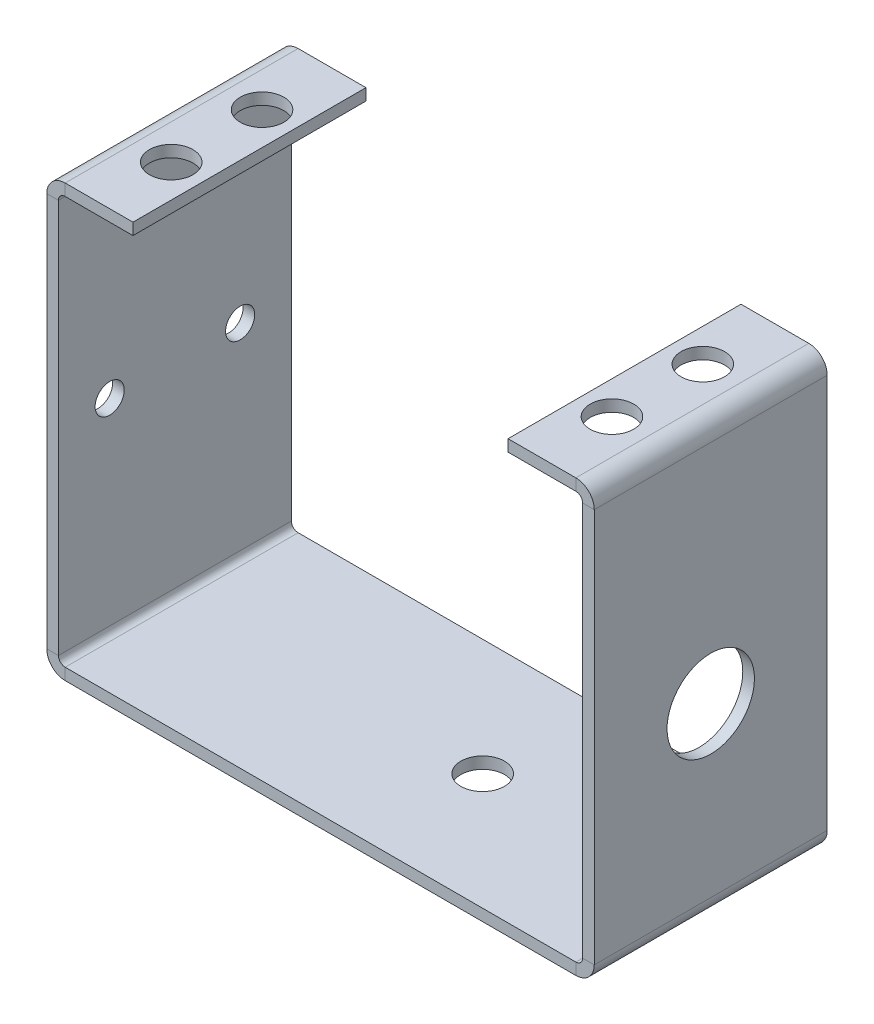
ISO-10303-21;
HEADER;
FILE_DESCRIPTION(('STEP AP214'),'2;1');
FILE_NAME('part.step','',(''),(''),'','','');
FILE_SCHEMA(('AUTOMOTIVE_DESIGN { 1 0 10303 214 1 1 1 1 }'));
ENDSEC;
DATA;
#1=APPLICATION_CONTEXT('core data for automotive mechanical design processes');
#2=APPLICATION_PROTOCOL_DEFINITION('international standard','automotive_design',2000,#1);
#3=PRODUCT_CONTEXT('',#1,'mechanical');
#4=PRODUCT('Part','Part','',(#3));
#5=PRODUCT_RELATED_PRODUCT_CATEGORY('part','',(#4));
#6=PRODUCT_DEFINITION_FORMATION('','',#4);
#7=PRODUCT_DEFINITION_CONTEXT('part definition',#1,'design');
#8=PRODUCT_DEFINITION('design','',#6,#7);
#9=PRODUCT_DEFINITION_SHAPE('','',#8);
#10=(LENGTH_UNIT() NAMED_UNIT(*) SI_UNIT(.MILLI.,.METRE.));
#11=(NAMED_UNIT(*) PLANE_ANGLE_UNIT() SI_UNIT($,.RADIAN.));
#12=(NAMED_UNIT(*) SI_UNIT($,.STERADIAN.) SOLID_ANGLE_UNIT());
#13=UNCERTAINTY_MEASURE_WITH_UNIT(LENGTH_MEASURE(1.E-05),#10,'distance_accuracy_value','');
#14=(GEOMETRIC_REPRESENTATION_CONTEXT(3) GLOBAL_UNCERTAINTY_ASSIGNED_CONTEXT((#13)) GLOBAL_UNIT_ASSIGNED_CONTEXT((#10,
#11,#12)) REPRESENTATION_CONTEXT('',''));
#15=CARTESIAN_POINT('',(0.,0.,0.));
#16=DIRECTION('',(0.,0.,1.));
#17=DIRECTION('',(1.,0.,0.));
#18=AXIS2_PLACEMENT_3D('',#15,#16,#17);
#19=CARTESIAN_POINT('',(3.12471507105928E-13,45.7200000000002,0.));
#20=DIRECTION('',(0.,1.,0.));
#21=DIRECTION('',(-1.,0.,0.));
#22=AXIS2_PLACEMENT_3D('',#19,#20,#21);
#23=PLANE('',#22);
#24=CARTESIAN_POINT('',(24.0284000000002,45.72,4.953));
#25=DIRECTION('',(0.,-1.,0.));
#26=DIRECTION('',(1.,0.,0.));
#27=AXIS2_PLACEMENT_3D('',#24,#25,#26);
#28=CIRCLE('',#27,2.3749);
#29=CARTESIAN_POINT('',(26.4033000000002,45.72,4.953));
#30=VERTEX_POINT('',#29);
#31=EDGE_CURVE('E395',#30,#30,#28,.T.);
#32=ORIENTED_EDGE('',*,*,#31,.T.);
#33=EDGE_LOOP('',(#32));
#34=FACE_BOUND('',#33,.T.);
#35=DIRECTION('',(-1.,0.,0.));
#36=VECTOR('',#35,1.);
#37=CARTESIAN_POINT('',(20.4470000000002,45.7200000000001,12.7));
#38=LINE('',#37,#36);
#39=CARTESIAN_POINT('',(27.8384000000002,45.72,12.7));
#40=VERTEX_POINT('',#39);
#41=CARTESIAN_POINT('',(20.4470000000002,45.7200000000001,12.7));
#42=VERTEX_POINT('',#41);
#43=EDGE_CURVE('E289',#40,#42,#38,.T.);
#44=ORIENTED_EDGE('',*,*,#43,.F.);
#45=DIRECTION('',(0.,0.,-1.));
#46=VECTOR('',#45,1.);
#47=CARTESIAN_POINT('',(27.8384000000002,45.72,0.));
#48=LINE('',#47,#46);
#49=CARTESIAN_POINT('',(27.8384000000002,45.72,-12.7));
#50=VERTEX_POINT('',#49);
#51=EDGE_CURVE('E283',#40,#50,#48,.T.);
#52=ORIENTED_EDGE('',*,*,#51,.T.);
#53=DIRECTION('',(1.,0.,0.));
#54=VECTOR('',#53,1.);
#55=CARTESIAN_POINT('',(28.5750000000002,45.72,-12.7));
#56=LINE('',#55,#54);
#57=CARTESIAN_POINT('',(20.4470000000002,45.7200000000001,-12.7));
#58=VERTEX_POINT('',#57);
#59=EDGE_CURVE('E295',#58,#50,#56,.T.);
#60=ORIENTED_EDGE('',*,*,#59,.F.);
#61=DIRECTION('',(0.,0.,-1.));
#62=VECTOR('',#61,1.);
#63=CARTESIAN_POINT('',(20.4470000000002,45.7200000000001,-12.7));
#64=LINE('',#63,#62);
#65=EDGE_CURVE('E291',#42,#58,#64,.T.);
#66=ORIENTED_EDGE('',*,*,#65,.F.);
#67=EDGE_LOOP('',(#44,#52,#60,#66));
#68=FACE_BOUND('',#67,.T.);
#69=CARTESIAN_POINT('',(24.0284000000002,45.72,-4.953));
#70=DIRECTION('',(0.,-1.,0.));
#71=DIRECTION('',(1.,0.,0.));
#72=AXIS2_PLACEMENT_3D('',#69,#70,#71);
#73=CIRCLE('',#72,2.3749);
#74=CARTESIAN_POINT('',(26.4033000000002,45.72,-4.953));
#75=VERTEX_POINT('',#74);
#76=EDGE_CURVE('E399',#75,#75,#73,.T.);
#77=ORIENTED_EDGE('',*,*,#76,.T.);
#78=EDGE_LOOP('',(#77));
#79=FACE_BOUND('',#78,.T.);
#80=ADVANCED_FACE('F35',(#34,#68,#79),#23,.T.);
#81=CARTESIAN_POINT('',(3.03576608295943E-13,44.4500000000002,0.));
#82=DIRECTION('',(0.,1.,0.));
#83=DIRECTION('',(-1.,0.,0.));
#84=AXIS2_PLACEMENT_3D('',#81,#82,#83);
#85=PLANE('',#84);
#86=CARTESIAN_POINT('',(24.0284000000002,44.45,4.953));
#87=DIRECTION('',(0.,1.,0.));
#88=DIRECTION('',(-1.,0.,0.));
#89=AXIS2_PLACEMENT_3D('',#86,#87,#88);
#90=CIRCLE('',#89,2.3749);
#91=CARTESIAN_POINT('',(21.6535000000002,44.45,4.953));
#92=VERTEX_POINT('',#91);
#93=EDGE_CURVE('E392',#92,#92,#90,.F.);
#94=ORIENTED_EDGE('',*,*,#93,.F.);
#95=EDGE_LOOP('',(#94));
#96=FACE_BOUND('',#95,.T.);
#97=DIRECTION('',(0.,0.,-1.));
#98=VECTOR('',#97,1.);
#99=CARTESIAN_POINT('',(27.8384000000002,44.45,12.7));
#100=LINE('',#99,#98);
#101=CARTESIAN_POINT('',(27.8384000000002,44.45,12.7));
#102=VERTEX_POINT('',#101);
#103=CARTESIAN_POINT('',(27.8384000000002,44.45,-12.7));
#104=VERTEX_POINT('',#103);
#105=EDGE_CURVE('E278',#102,#104,#100,.T.);
#106=ORIENTED_EDGE('',*,*,#105,.F.);
#107=DIRECTION('',(-1.,0.,0.));
#108=VECTOR('',#107,1.);
#109=CARTESIAN_POINT('',(20.4470000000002,44.4500000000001,12.7));
#110=LINE('',#109,#108);
#111=CARTESIAN_POINT('',(20.4470000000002,44.4500000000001,12.7));
#112=VERTEX_POINT('',#111);
#113=EDGE_CURVE('E288',#102,#112,#110,.T.);
#114=ORIENTED_EDGE('',*,*,#113,.T.);
#115=DIRECTION('',(0.,0.,-1.));
#116=VECTOR('',#115,1.);
#117=CARTESIAN_POINT('',(20.4470000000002,44.4500000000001,-12.7));
#118=LINE('',#117,#116);
#119=CARTESIAN_POINT('',(20.4470000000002,44.4500000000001,-12.7));
#120=VERTEX_POINT('',#119);
#121=EDGE_CURVE('E300',#112,#120,#118,.T.);
#122=ORIENTED_EDGE('',*,*,#121,.T.);
#123=DIRECTION('',(1.,0.,0.));
#124=VECTOR('',#123,1.);
#125=CARTESIAN_POINT('',(28.5750000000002,44.45,-12.7));
#126=LINE('',#125,#124);
#127=EDGE_CURVE('E292',#120,#104,#126,.T.);
#128=ORIENTED_EDGE('',*,*,#127,.T.);
#129=EDGE_LOOP('',(#106,#114,#122,#128));
#130=FACE_BOUND('',#129,.T.);
#131=CARTESIAN_POINT('',(24.0284000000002,44.45,-4.953));
#132=DIRECTION('',(0.,1.,0.));
#133=DIRECTION('',(-1.,0.,0.));
#134=AXIS2_PLACEMENT_3D('',#131,#132,#133);
#135=CIRCLE('',#134,2.3749);
#136=CARTESIAN_POINT('',(21.6535000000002,44.45,-4.953));
#137=VERTEX_POINT('',#136);
#138=EDGE_CURVE('E396',#137,#137,#135,.F.);
#139=ORIENTED_EDGE('',*,*,#138,.F.);
#140=EDGE_LOOP('',(#139));
#141=FACE_BOUND('',#140,.T.);
#142=ADVANCED_FACE('F474',(#96,#130,#141),#85,.F.);
#143=CARTESIAN_POINT('',(-29.845,0.,12.7));
#144=DIRECTION('',(0.,0.,1.));
#145=DIRECTION('',(1.,0.,0.));
#146=AXIS2_PLACEMENT_3D('',#143,#144,#145);
#147=PLANE('',#146);
#148=DIRECTION('',(0.,-1.,0.));
#149=VECTOR('',#148,1.);
#150=CARTESIAN_POINT('',(-28.575,0.,12.7));
#151=LINE('',#150,#149);
#152=CARTESIAN_POINT('',(-28.5750000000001,43.7134,12.7));
#153=VERTEX_POINT('',#152);
#154=CARTESIAN_POINT('',(-28.575,0.736599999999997,12.7));
#155=VERTEX_POINT('',#154);
#156=EDGE_CURVE('E245',#153,#155,#151,.T.);
#157=ORIENTED_EDGE('',*,*,#156,.F.);
#158=DIRECTION('',(-1.,0.,0.));
#159=VECTOR('',#158,1.);
#160=CARTESIAN_POINT('',(-28.5750000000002,43.7134,12.7));
#161=LINE('',#160,#159);
#162=CARTESIAN_POINT('',(-29.8450000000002,43.7134,12.7));
#163=VERTEX_POINT('',#162);
#164=EDGE_CURVE('E220',#153,#163,#161,.T.);
#165=ORIENTED_EDGE('',*,*,#164,.T.);
#166=DIRECTION('',(0.,-1.,0.));
#167=VECTOR('',#166,1.);
#168=CARTESIAN_POINT('',(-29.845,0.,12.7));
#169=LINE('',#168,#167);
#170=CARTESIAN_POINT('',(-29.845,0.736599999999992,12.7));
#171=VERTEX_POINT('',#170);
#172=EDGE_CURVE('E246',#163,#171,#169,.T.);
#173=ORIENTED_EDGE('',*,*,#172,.T.);
#174=DIRECTION('',(-1.,0.,0.));
#175=VECTOR('',#174,1.);
#176=CARTESIAN_POINT('',(-28.575,0.736599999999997,12.7));
#177=LINE('',#176,#175);
#178=EDGE_CURVE('E238',#155,#171,#177,.T.);
#179=ORIENTED_EDGE('',*,*,#178,.F.);
#180=EDGE_LOOP('',(#157,#165,#173,#179));
#181=FACE_BOUND('',#180,.T.);
#182=ADVANCED_FACE('F450',(#181),#147,.T.);
#183=CARTESIAN_POINT('',(-29.845,-1.0480032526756E-13,0.));
#184=DIRECTION('',(1.,0.,0.));
#185=DIRECTION('',(0.,-1.,0.));
#186=AXIS2_PLACEMENT_3D('',#183,#184,#185);
#187=PLANE('',#186);
#188=CARTESIAN_POINT('',(-29.8450000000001,22.225,-7.112));
#189=DIRECTION('',(-1.,0.,0.));
#190=DIRECTION('',(0.,1.,0.));
#191=AXIS2_PLACEMENT_3D('',#188,#189,#190);
#192=CIRCLE('',#191,1.5875);
#193=CARTESIAN_POINT('',(-29.8450000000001,23.8125,-7.112));
#194=VERTEX_POINT('',#193);
#195=EDGE_CURVE('E405',#194,#194,#192,.T.);
#196=ORIENTED_EDGE('',*,*,#195,.F.);
#197=EDGE_LOOP('',(#196));
#198=FACE_BOUND('',#197,.T.);
#199=CARTESIAN_POINT('',(-29.8450000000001,22.225,7.112));
#200=DIRECTION('',(-1.,0.,0.));
#201=DIRECTION('',(0.,-1.,0.));
#202=AXIS2_PLACEMENT_3D('',#199,#200,#201);
#203=CIRCLE('',#202,1.5875);
#204=CARTESIAN_POINT('',(-29.8450000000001,20.6375,7.112));
#205=VERTEX_POINT('',#204);
#206=EDGE_CURVE('E402',#205,#205,#203,.T.);
#207=ORIENTED_EDGE('',*,*,#206,.F.);
#208=EDGE_LOOP('',(#207));
#209=FACE_BOUND('',#208,.T.);
#210=DIRECTION('',(0.,0.,1.));
#211=VECTOR('',#210,1.);
#212=CARTESIAN_POINT('',(-29.8450000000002,43.7134,12.7));
#213=LINE('',#212,#211);
#214=CARTESIAN_POINT('',(-29.8450000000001,43.7134,-12.7));
#215=VERTEX_POINT('',#214);
#216=EDGE_CURVE('E214',#163,#215,#213,.F.);
#217=ORIENTED_EDGE('',*,*,#216,.T.);
#218=DIRECTION('',(0.,1.,0.));
#219=VECTOR('',#218,1.);
#220=CARTESIAN_POINT('',(-29.8450000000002,44.45,-12.7));
#221=LINE('',#220,#219);
#222=CARTESIAN_POINT('',(-29.845,0.736599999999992,-12.7));
#223=VERTEX_POINT('',#222);
#224=EDGE_CURVE('E248',#223,#215,#221,.T.);
#225=ORIENTED_EDGE('',*,*,#224,.F.);
#226=DIRECTION('',(0.,0.,-1.));
#227=VECTOR('',#226,1.);
#228=CARTESIAN_POINT('',(-29.845,0.736599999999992,0.));
#229=LINE('',#228,#227);
#230=EDGE_CURVE('E241',#171,#223,#229,.T.);
#231=ORIENTED_EDGE('',*,*,#230,.F.);
#232=ORIENTED_EDGE('',*,*,#172,.F.);
#233=EDGE_LOOP('',(#217,#225,#231,#232));
#234=FACE_BOUND('',#233,.T.);
#235=ADVANCED_FACE('F456',(#198,#209,#234),#187,.F.);
#236=CARTESIAN_POINT('',(-28.575,-1.0036614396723E-13,0.));
#237=DIRECTION('',(1.,0.,0.));
#238=DIRECTION('',(0.,-1.,0.));
#239=AXIS2_PLACEMENT_3D('',#236,#237,#238);
#240=PLANE('',#239);
#241=CARTESIAN_POINT('',(-28.5750000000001,22.225,-7.112));
#242=DIRECTION('',(1.,0.,0.));
#243=DIRECTION('',(0.,1.,0.));
#244=AXIS2_PLACEMENT_3D('',#241,#242,#243);
#245=CIRCLE('',#244,1.5875);
#246=CARTESIAN_POINT('',(-28.5750000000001,23.8125,-7.112));
#247=VERTEX_POINT('',#246);
#248=EDGE_CURVE('E403',#247,#247,#245,.T.);
#249=ORIENTED_EDGE('',*,*,#248,.F.);
#250=EDGE_LOOP('',(#249));
#251=FACE_BOUND('',#250,.T.);
#252=CARTESIAN_POINT('',(-28.5750000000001,22.225,7.112));
#253=DIRECTION('',(1.,0.,0.));
#254=DIRECTION('',(0.,1.,0.));
#255=AXIS2_PLACEMENT_3D('',#252,#253,#254);
#256=CIRCLE('',#255,1.5875);
#257=CARTESIAN_POINT('',(-28.5750000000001,23.8125,7.112));
#258=VERTEX_POINT('',#257);
#259=EDGE_CURVE('E400',#258,#258,#256,.T.);
#260=ORIENTED_EDGE('',*,*,#259,.F.);
#261=EDGE_LOOP('',(#260));
#262=FACE_BOUND('',#261,.T.);
#263=DIRECTION('',(0.,1.,0.));
#264=VECTOR('',#263,1.);
#265=CARTESIAN_POINT('',(-28.5750000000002,44.45,-12.7));
#266=LINE('',#265,#264);
#267=CARTESIAN_POINT('',(-28.575,0.736599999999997,-12.7));
#268=VERTEX_POINT('',#267);
#269=CARTESIAN_POINT('',(-28.5750000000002,43.7134,-12.7));
#270=VERTEX_POINT('',#269);
#271=EDGE_CURVE('E249',#268,#270,#266,.T.);
#272=ORIENTED_EDGE('',*,*,#271,.T.);
#273=DIRECTION('',(0.,0.,1.));
#274=VECTOR('',#273,1.);
#275=CARTESIAN_POINT('',(-28.5750000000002,43.7134,12.7));
#276=LINE('',#275,#274);
#277=EDGE_CURVE('E52',#153,#270,#276,.F.);
#278=ORIENTED_EDGE('',*,*,#277,.F.);
#279=ORIENTED_EDGE('',*,*,#156,.T.);
#280=DIRECTION('',(0.,0.,1.));
#281=VECTOR('',#280,1.);
#282=CARTESIAN_POINT('',(-28.575,0.736599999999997,-12.7));
#283=LINE('',#282,#281);
#284=EDGE_CURVE('E235',#268,#155,#283,.T.);
#285=ORIENTED_EDGE('',*,*,#284,.F.);
#286=EDGE_LOOP('',(#272,#278,#279,#285));
#287=FACE_BOUND('',#286,.T.);
#288=ADVANCED_FACE('F553',(#251,#262,#287),#240,.T.);
#289=CARTESIAN_POINT('',(0.,-1.27,0.));
#290=DIRECTION('',(0.,-1.,0.));
#291=DIRECTION('',(0.,0.,-1.));
#292=AXIS2_PLACEMENT_3D('',#289,#290,#291);
#293=PLANE('',#292);
#294=CARTESIAN_POINT('',(4.9784,-1.27,0.));
#295=DIRECTION('',(0.,-1.,0.));
#296=DIRECTION('',(0.,0.,-1.));
#297=AXIS2_PLACEMENT_3D('',#294,#295,#296);
#298=CIRCLE('',#297,2.38125);
#299=CARTESIAN_POINT('',(4.9784,-1.27,-2.38125));
#300=VERTEX_POINT('',#299);
#301=EDGE_CURVE('E415',#300,#300,#298,.T.);
#302=ORIENTED_EDGE('',*,*,#301,.F.);
#303=EDGE_LOOP('',(#302));
#304=FACE_BOUND('',#303,.T.);
#305=DIRECTION('',(1.,0.,0.));
#306=VECTOR('',#305,1.);
#307=CARTESIAN_POINT('',(-28.575,-1.27,12.7));
#308=LINE('',#307,#306);
#309=CARTESIAN_POINT('',(-27.8384,-1.27,12.7));
#310=VERTEX_POINT('',#309);
#311=CARTESIAN_POINT('',(27.8384,-1.27,12.7));
#312=VERTEX_POINT('',#311);
#313=EDGE_CURVE('E11',#310,#312,#308,.T.);
#314=ORIENTED_EDGE('',*,*,#313,.F.);
#315=DIRECTION('',(0.,0.,1.));
#316=VECTOR('',#315,1.);
#317=CARTESIAN_POINT('',(-27.8384,-1.27,12.7));
#318=LINE('',#317,#316);
#319=CARTESIAN_POINT('',(-27.8384,-1.27,-12.7));
#320=VERTEX_POINT('',#319);
#321=EDGE_CURVE('E255',#310,#320,#318,.F.);
#322=ORIENTED_EDGE('',*,*,#321,.T.);
#323=DIRECTION('',(-1.,0.,0.));
#324=VECTOR('',#323,1.);
#325=CARTESIAN_POINT('',(-28.575,-1.27,-12.7));
#326=LINE('',#325,#324);
#327=CARTESIAN_POINT('',(27.8384,-1.27,-12.7));
#328=VERTEX_POINT('',#327);
#329=EDGE_CURVE('E44',#328,#320,#326,.T.);
#330=ORIENTED_EDGE('',*,*,#329,.F.);
#331=DIRECTION('',(0.,0.,-1.));
#332=VECTOR('',#331,1.);
#333=CARTESIAN_POINT('',(27.8384,-1.27,-12.7));
#334=LINE('',#333,#332);
#335=EDGE_CURVE('E350',#328,#312,#334,.F.);
#336=ORIENTED_EDGE('',*,*,#335,.T.);
#337=EDGE_LOOP('',(#314,#322,#330,#336));
#338=FACE_BOUND('',#337,.T.);
#339=ADVANCED_FACE('F549',(#304,#338),#293,.T.);
#340=CARTESIAN_POINT('',(0.,0.,0.));
#341=DIRECTION('',(0.,-1.,0.));
#342=DIRECTION('',(0.,0.,-1.));
#343=AXIS2_PLACEMENT_3D('',#340,#341,#342);
#344=PLANE('',#343);
#345=CARTESIAN_POINT('',(4.9784,0.,0.));
#346=DIRECTION('',(0.,-1.,0.));
#347=DIRECTION('',(0.,0.,-1.));
#348=AXIS2_PLACEMENT_3D('',#345,#346,#347);
#349=CIRCLE('',#348,2.38125);
#350=CARTESIAN_POINT('',(4.9784,0.,-2.38125));
#351=VERTEX_POINT('',#350);
#352=EDGE_CURVE('E39',#351,#351,#349,.T.);
#353=ORIENTED_EDGE('',*,*,#352,.T.);
#354=EDGE_LOOP('',(#353));
#355=FACE_BOUND('',#354,.T.);
#356=DIRECTION('',(0.,0.,1.));
#357=VECTOR('',#356,1.);
#358=CARTESIAN_POINT('',(-27.8384,0.,12.7));
#359=LINE('',#358,#357);
#360=CARTESIAN_POINT('',(-27.8384,0.,12.7));
#361=VERTEX_POINT('',#360);
#362=CARTESIAN_POINT('',(-27.8384,0.,-12.7));
#363=VERTEX_POINT('',#362);
#364=EDGE_CURVE('E268',#361,#363,#359,.F.);
#365=ORIENTED_EDGE('',*,*,#364,.F.);
#366=DIRECTION('',(1.,0.,0.));
#367=VECTOR('',#366,1.);
#368=CARTESIAN_POINT('',(-28.575,0.,12.7));
#369=LINE('',#368,#367);
#370=CARTESIAN_POINT('',(27.8384,0.,12.7));
#371=VERTEX_POINT('',#370);
#372=EDGE_CURVE('E375',#361,#371,#369,.T.);
#373=ORIENTED_EDGE('',*,*,#372,.T.);
#374=DIRECTION('',(0.,0.,-1.));
#375=VECTOR('',#374,1.);
#376=CARTESIAN_POINT('',(27.8384,0.,-12.7));
#377=LINE('',#376,#375);
#378=CARTESIAN_POINT('',(27.8384,0.,-12.7));
#379=VERTEX_POINT('',#378);
#380=EDGE_CURVE('E363',#379,#371,#377,.F.);
#381=ORIENTED_EDGE('',*,*,#380,.F.);
#382=DIRECTION('',(-1.,0.,0.));
#383=VECTOR('',#382,1.);
#384=CARTESIAN_POINT('',(-28.575,0.,-12.7));
#385=LINE('',#384,#383);
#386=EDGE_CURVE('E371',#379,#363,#385,.T.);
#387=ORIENTED_EDGE('',*,*,#386,.T.);
#388=EDGE_LOOP('',(#365,#373,#381,#387));
#389=FACE_BOUND('',#388,.T.);
#390=ADVANCED_FACE('F552',(#355,#389),#344,.F.);
#391=CARTESIAN_POINT('',(-28.575,-1.27,12.7));
#392=DIRECTION('',(0.,0.,1.));
#393=DIRECTION('',(1.,0.,0.));
#394=AXIS2_PLACEMENT_3D('',#391,#392,#393);
#395=PLANE('',#394);
#396=ORIENTED_EDGE('',*,*,#372,.F.);
#397=DIRECTION('',(0.,-1.,0.));
#398=VECTOR('',#397,1.);
#399=CARTESIAN_POINT('',(-27.8384,0.,12.7));
#400=LINE('',#399,#398);
#401=EDGE_CURVE('E262',#361,#310,#400,.T.);
#402=ORIENTED_EDGE('',*,*,#401,.T.);
#403=ORIENTED_EDGE('',*,*,#313,.T.);
#404=DIRECTION('',(0.,-1.,0.));
#405=VECTOR('',#404,1.);
#406=CARTESIAN_POINT('',(27.8384,0.,12.7));
#407=LINE('',#406,#405);
#408=EDGE_CURVE('E368',#371,#312,#407,.T.);
#409=ORIENTED_EDGE('',*,*,#408,.F.);
#410=EDGE_LOOP('',(#396,#402,#403,#409));
#411=FACE_BOUND('',#410,.T.);
#412=ADVANCED_FACE('F532',(#411),#395,.T.);
#413=CARTESIAN_POINT('',(29.8450000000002,44.45,-12.7));
#414=DIRECTION('',(0.,0.,1.));
#415=DIRECTION('',(1.,0.,0.));
#416=AXIS2_PLACEMENT_3D('',#413,#414,#415);
#417=PLANE('',#416);
#418=DIRECTION('',(1.,0.,0.));
#419=VECTOR('',#418,1.);
#420=CARTESIAN_POINT('',(28.5750000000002,43.7134,-12.7));
#421=LINE('',#420,#419);
#422=CARTESIAN_POINT('',(28.5750000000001,43.7134,-12.7));
#423=VERTEX_POINT('',#422);
#424=CARTESIAN_POINT('',(29.8450000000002,43.7134,-12.7));
#425=VERTEX_POINT('',#424);
#426=EDGE_CURVE('E316',#423,#425,#421,.T.);
#427=ORIENTED_EDGE('',*,*,#426,.T.);
#428=DIRECTION('',(0.,1.,0.));
#429=VECTOR('',#428,1.);
#430=CARTESIAN_POINT('',(29.8450000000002,44.45,-12.7));
#431=LINE('',#430,#429);
#432=CARTESIAN_POINT('',(29.845,0.736599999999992,-12.7));
#433=VERTEX_POINT('',#432);
#434=EDGE_CURVE('E342',#433,#425,#431,.T.);
#435=ORIENTED_EDGE('',*,*,#434,.F.);
#436=DIRECTION('',(1.,0.,0.));
#437=VECTOR('',#436,1.);
#438=CARTESIAN_POINT('',(28.575,0.736599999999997,-12.7));
#439=LINE('',#438,#437);
#440=CARTESIAN_POINT('',(28.575,0.736599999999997,-12.7));
#441=VERTEX_POINT('',#440);
#442=EDGE_CURVE('E333',#441,#433,#439,.T.);
#443=ORIENTED_EDGE('',*,*,#442,.F.);
#444=DIRECTION('',(0.,1.,0.));
#445=VECTOR('',#444,1.);
#446=CARTESIAN_POINT('',(28.5750000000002,44.45,-12.7));
#447=LINE('',#446,#445);
#448=EDGE_CURVE('E341',#441,#423,#447,.T.);
#449=ORIENTED_EDGE('',*,*,#448,.T.);
#450=EDGE_LOOP('',(#427,#435,#443,#449));
#451=FACE_BOUND('',#450,.T.);
#452=ADVANCED_FACE('F528',(#451),#417,.F.);
#453=CARTESIAN_POINT('',(29.845,0.,12.7));
#454=DIRECTION('',(0.,0.,-1.));
#455=DIRECTION('',(-1.,0.,0.));
#456=AXIS2_PLACEMENT_3D('',#453,#454,#455);
#457=PLANE('',#456);
#458=DIRECTION('',(1.,0.,0.));
#459=VECTOR('',#458,1.);
#460=CARTESIAN_POINT('',(28.5750000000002,43.7134,12.7));
#461=LINE('',#460,#459);
#462=CARTESIAN_POINT('',(28.5750000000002,43.7134,12.7));
#463=VERTEX_POINT('',#462);
#464=CARTESIAN_POINT('',(29.8450000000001,43.7134,12.7));
#465=VERTEX_POINT('',#464);
#466=EDGE_CURVE('E325',#463,#465,#461,.T.);
#467=ORIENTED_EDGE('',*,*,#466,.F.);
#468=DIRECTION('',(0.,-1.,0.));
#469=VECTOR('',#468,1.);
#470=CARTESIAN_POINT('',(28.575,0.,12.7));
#471=LINE('',#470,#469);
#472=CARTESIAN_POINT('',(28.575,0.736599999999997,12.7));
#473=VERTEX_POINT('',#472);
#474=EDGE_CURVE('E345',#463,#473,#471,.T.);
#475=ORIENTED_EDGE('',*,*,#474,.T.);
#476=DIRECTION('',(1.,0.,0.));
#477=VECTOR('',#476,1.);
#478=CARTESIAN_POINT('',(28.575,0.736599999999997,12.7));
#479=LINE('',#478,#477);
#480=CARTESIAN_POINT('',(29.845,0.736599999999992,12.7));
#481=VERTEX_POINT('',#480);
#482=EDGE_CURVE('E328',#473,#481,#479,.T.);
#483=ORIENTED_EDGE('',*,*,#482,.T.);
#484=DIRECTION('',(0.,-1.,0.));
#485=VECTOR('',#484,1.);
#486=CARTESIAN_POINT('',(29.845,0.,12.7));
#487=LINE('',#486,#485);
#488=EDGE_CURVE('E344',#465,#481,#487,.T.);
#489=ORIENTED_EDGE('',*,*,#488,.F.);
#490=EDGE_LOOP('',(#467,#475,#483,#489));
#491=FACE_BOUND('',#490,.T.);
#492=ADVANCED_FACE('F521',(#491),#457,.F.);
#493=CARTESIAN_POINT('',(29.845,-1.0480032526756E-13,0.));
#494=DIRECTION('',(-1.,0.,0.));
#495=DIRECTION('',(0.,-1.,0.));
#496=AXIS2_PLACEMENT_3D('',#493,#494,#495);
#497=PLANE('',#496);
#498=CARTESIAN_POINT('',(29.8450000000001,19.0499999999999,0.));
#499=DIRECTION('',(1.,0.,0.));
#500=DIRECTION('',(0.,1.,0.));
#501=AXIS2_PLACEMENT_3D('',#498,#499,#500);
#502=CIRCLE('',#501,4.7625);
#503=CARTESIAN_POINT('',(29.8450000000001,23.8124999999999,0.));
#504=VERTEX_POINT('',#503);
#505=EDGE_CURVE('E383',#504,#504,#502,.T.);
#506=ORIENTED_EDGE('',*,*,#505,.F.);
#507=EDGE_LOOP('',(#506));
#508=FACE_BOUND('',#507,.T.);
#509=DIRECTION('',(0.,0.,-1.));
#510=VECTOR('',#509,1.);
#511=CARTESIAN_POINT('',(29.8450000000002,43.7134,-12.7));
#512=LINE('',#511,#510);
#513=EDGE_CURVE('E310',#425,#465,#512,.F.);
#514=ORIENTED_EDGE('',*,*,#513,.T.);
#515=ORIENTED_EDGE('',*,*,#488,.T.);
#516=DIRECTION('',(0.,0.,1.));
#517=VECTOR('',#516,1.);
#518=CARTESIAN_POINT('',(29.845,0.736599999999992,0.));
#519=LINE('',#518,#517);
#520=EDGE_CURVE('E336',#433,#481,#519,.T.);
#521=ORIENTED_EDGE('',*,*,#520,.F.);
#522=ORIENTED_EDGE('',*,*,#434,.T.);
#523=EDGE_LOOP('',(#514,#515,#521,#522));
#524=FACE_BOUND('',#523,.T.);
#525=ADVANCED_FACE('F517',(#508,#524),#497,.F.);
#526=CARTESIAN_POINT('',(28.575,-1.0036614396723E-13,0.));
#527=DIRECTION('',(-1.,0.,0.));
#528=DIRECTION('',(0.,-1.,0.));
#529=AXIS2_PLACEMENT_3D('',#526,#527,#528);
#530=PLANE('',#529);
#531=CARTESIAN_POINT('',(28.5750000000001,19.0499999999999,0.));
#532=DIRECTION('',(-1.,0.,0.));
#533=DIRECTION('',(0.,-1.,0.));
#534=AXIS2_PLACEMENT_3D('',#531,#532,#533);
#535=CIRCLE('',#534,4.7625);
#536=CARTESIAN_POINT('',(28.575,14.2874999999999,0.));
#537=VERTEX_POINT('',#536);
#538=EDGE_CURVE('E380',#537,#537,#535,.T.);
#539=ORIENTED_EDGE('',*,*,#538,.F.);
#540=EDGE_LOOP('',(#539));
#541=FACE_BOUND('',#540,.T.);
#542=ORIENTED_EDGE('',*,*,#474,.F.);
#543=DIRECTION('',(0.,0.,-1.));
#544=VECTOR('',#543,1.);
#545=CARTESIAN_POINT('',(28.5750000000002,43.7134,-12.7));
#546=LINE('',#545,#544);
#547=EDGE_CURVE('E60',#423,#463,#546,.F.);
#548=ORIENTED_EDGE('',*,*,#547,.F.);
#549=ORIENTED_EDGE('',*,*,#448,.F.);
#550=DIRECTION('',(0.,0.,-1.));
#551=VECTOR('',#550,1.);
#552=CARTESIAN_POINT('',(28.575,0.736599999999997,12.7));
#553=LINE('',#552,#551);
#554=EDGE_CURVE('E331',#473,#441,#553,.T.);
#555=ORIENTED_EDGE('',*,*,#554,.F.);
#556=EDGE_LOOP('',(#542,#548,#549,#555));
#557=FACE_BOUND('',#556,.T.);
#558=ADVANCED_FACE('F520',(#541,#557),#530,.T.);
#559=CARTESIAN_POINT('',(-28.575,-1.27,-12.7));
#560=DIRECTION('',(0.,0.,-1.));
#561=DIRECTION('',(-1.,0.,0.));
#562=AXIS2_PLACEMENT_3D('',#559,#560,#561);
#563=PLANE('',#562);
#564=DIRECTION('',(0.,-1.,0.));
#565=VECTOR('',#564,1.);
#566=CARTESIAN_POINT('',(-27.8384,0.,-12.7));
#567=LINE('',#566,#565);
#568=EDGE_CURVE('E272',#363,#320,#567,.T.);
#569=ORIENTED_EDGE('',*,*,#568,.F.);
#570=ORIENTED_EDGE('',*,*,#386,.F.);
#571=DIRECTION('',(0.,-1.,0.));
#572=VECTOR('',#571,1.);
#573=CARTESIAN_POINT('',(27.8384,0.,-12.7));
#574=LINE('',#573,#572);
#575=EDGE_CURVE('E357',#379,#328,#574,.T.);
#576=ORIENTED_EDGE('',*,*,#575,.T.);
#577=ORIENTED_EDGE('',*,*,#329,.T.);
#578=EDGE_LOOP('',(#569,#570,#576,#577));
#579=FACE_BOUND('',#578,.T.);
#580=ADVANCED_FACE('F37',(#579),#563,.T.);
#581=CARTESIAN_POINT('',(27.8384,0.7366,12.7));
#582=DIRECTION('',(0.,0.,1.));
#583=DIRECTION('',(1.,0.,0.));
#584=AXIS2_PLACEMENT_3D('',#581,#582,#583);
#585=PLANE('',#584);
#586=ORIENTED_EDGE('',*,*,#482,.F.);
#587=CARTESIAN_POINT('',(27.8384,0.7366,12.7));
#588=DIRECTION('',(0.,0.,-1.));
#589=DIRECTION('',(-1.,0.,0.));
#590=AXIS2_PLACEMENT_3D('',#587,#588,#589);
#591=CIRCLE('',#590,0.7366);
#592=EDGE_CURVE('E360',#371,#473,#591,.F.);
#593=ORIENTED_EDGE('',*,*,#592,.F.);
#594=ORIENTED_EDGE('',*,*,#408,.T.);
#595=CARTESIAN_POINT('',(27.8384,0.7366,12.7));
#596=DIRECTION('',(0.,0.,-1.));
#597=DIRECTION('',(-1.,0.,0.));
#598=AXIS2_PLACEMENT_3D('',#595,#596,#597);
#599=CIRCLE('',#598,2.0066);
#600=EDGE_CURVE('E353',#312,#481,#599,.F.);
#601=ORIENTED_EDGE('',*,*,#600,.T.);
#602=EDGE_LOOP('',(#586,#593,#594,#601));
#603=FACE_BOUND('',#602,.T.);
#604=ADVANCED_FACE('F542',(#603),#585,.T.);
#605=CARTESIAN_POINT('',(27.8384,0.7366,-12.7));
#606=DIRECTION('',(0.,0.,1.));
#607=DIRECTION('',(1.,0.,0.));
#608=AXIS2_PLACEMENT_3D('',#605,#606,#607);
#609=PLANE('',#608);
#610=CARTESIAN_POINT('',(27.8384,0.7366,-12.7));
#611=DIRECTION('',(0.,0.,-1.));
#612=DIRECTION('',(-1.,0.,0.));
#613=AXIS2_PLACEMENT_3D('',#610,#611,#612);
#614=CIRCLE('',#613,0.7366);
#615=EDGE_CURVE('E347',#441,#379,#614,.T.);
#616=ORIENTED_EDGE('',*,*,#615,.F.);
#617=ORIENTED_EDGE('',*,*,#442,.T.);
#618=CARTESIAN_POINT('',(27.8384,0.7366,-12.7));
#619=DIRECTION('',(0.,0.,-1.));
#620=DIRECTION('',(-1.,0.,0.));
#621=AXIS2_PLACEMENT_3D('',#618,#619,#620);
#622=CIRCLE('',#621,2.0066);
#623=EDGE_CURVE('E354',#433,#328,#622,.T.);
#624=ORIENTED_EDGE('',*,*,#623,.T.);
#625=ORIENTED_EDGE('',*,*,#575,.F.);
#626=EDGE_LOOP('',(#616,#617,#624,#625));
#627=FACE_BOUND('',#626,.T.);
#628=ADVANCED_FACE('F537',(#627),#609,.F.);
#629=CARTESIAN_POINT('',(27.8384,0.7366,-12.7));
#630=DIRECTION('',(0.,0.,-1.));
#631=DIRECTION('',(1.,0.,0.));
#632=AXIS2_PLACEMENT_3D('',#629,#630,#631);
#633=CYLINDRICAL_SURFACE('',#632,2.0066);
#634=ORIENTED_EDGE('',*,*,#335,.F.);
#635=ORIENTED_EDGE('',*,*,#623,.F.);
#636=ORIENTED_EDGE('',*,*,#520,.T.);
#637=ORIENTED_EDGE('',*,*,#600,.F.);
#638=EDGE_LOOP('',(#634,#635,#636,#637));
#639=FACE_BOUND('',#638,.T.);
#640=ADVANCED_FACE('F534',(#639),#633,.T.);
#641=CARTESIAN_POINT('',(27.8384,0.7366,-12.7));
#642=DIRECTION('',(0.,0.,-1.));
#643=DIRECTION('',(1.,0.,0.));
#644=AXIS2_PLACEMENT_3D('',#641,#642,#643);
#645=CYLINDRICAL_SURFACE('',#644,0.7366);
#646=ORIENTED_EDGE('',*,*,#380,.T.);
#647=ORIENTED_EDGE('',*,*,#592,.T.);
#648=ORIENTED_EDGE('',*,*,#554,.T.);
#649=ORIENTED_EDGE('',*,*,#615,.T.);
#650=EDGE_LOOP('',(#646,#647,#648,#649));
#651=FACE_BOUND('',#650,.T.);
#652=ADVANCED_FACE('F512',(#651),#645,.F.);
#653=CARTESIAN_POINT('',(27.8384000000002,43.7134,12.7));
#654=DIRECTION('',(0.,0.,1.));
#655=DIRECTION('',(1.,0.,0.));
#656=AXIS2_PLACEMENT_3D('',#653,#654,#655);
#657=PLANE('',#656);
#658=DIRECTION('',(0.,1.,0.));
#659=VECTOR('',#658,1.);
#660=CARTESIAN_POINT('',(27.8384000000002,44.45,12.7));
#661=LINE('',#660,#659);
#662=EDGE_CURVE('E275',#102,#40,#661,.T.);
#663=ORIENTED_EDGE('',*,*,#662,.F.);
#664=CARTESIAN_POINT('',(27.8384000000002,43.7134,12.7));
#665=DIRECTION('',(0.,0.,-1.));
#666=DIRECTION('',(-1.,0.,0.));
#667=AXIS2_PLACEMENT_3D('',#664,#665,#666);
#668=CIRCLE('',#667,0.736600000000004);
#669=EDGE_CURVE('E319',#463,#102,#668,.F.);
#670=ORIENTED_EDGE('',*,*,#669,.F.);
#671=ORIENTED_EDGE('',*,*,#466,.T.);
#672=CARTESIAN_POINT('',(27.8384000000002,43.7134,12.7));
#673=DIRECTION('',(0.,0.,-1.));
#674=DIRECTION('',(-1.,0.,0.));
#675=AXIS2_PLACEMENT_3D('',#672,#673,#674);
#676=CIRCLE('',#675,2.0066);
#677=EDGE_CURVE('E312',#465,#40,#676,.F.);
#678=ORIENTED_EDGE('',*,*,#677,.T.);
#679=EDGE_LOOP('',(#663,#670,#671,#678));
#680=FACE_BOUND('',#679,.T.);
#681=ADVANCED_FACE('F509',(#680),#657,.T.);
#682=CARTESIAN_POINT('',(27.8384000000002,43.7134,-12.7));
#683=DIRECTION('',(0.,0.,1.));
#684=DIRECTION('',(1.,0.,0.));
#685=AXIS2_PLACEMENT_3D('',#682,#683,#684);
#686=PLANE('',#685);
#687=CARTESIAN_POINT('',(27.8384000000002,43.7134,-12.7));
#688=DIRECTION('',(0.,0.,-1.));
#689=DIRECTION('',(-1.,0.,0.));
#690=AXIS2_PLACEMENT_3D('',#687,#688,#689);
#691=CIRCLE('',#690,0.736600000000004);
#692=EDGE_CURVE('E307',#104,#423,#691,.T.);
#693=ORIENTED_EDGE('',*,*,#692,.F.);
#694=DIRECTION('',(0.,1.,0.));
#695=VECTOR('',#694,1.);
#696=CARTESIAN_POINT('',(27.8384000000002,44.45,-12.7));
#697=LINE('',#696,#695);
#698=EDGE_CURVE('E280',#104,#50,#697,.T.);
#699=ORIENTED_EDGE('',*,*,#698,.T.);
#700=CARTESIAN_POINT('',(27.8384000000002,43.7134,-12.7));
#701=DIRECTION('',(0.,0.,-1.));
#702=DIRECTION('',(-1.,0.,0.));
#703=AXIS2_PLACEMENT_3D('',#700,#701,#702);
#704=CIRCLE('',#703,2.0066);
#705=EDGE_CURVE('E313',#50,#425,#704,.T.);
#706=ORIENTED_EDGE('',*,*,#705,.T.);
#707=ORIENTED_EDGE('',*,*,#426,.F.);
#708=EDGE_LOOP('',(#693,#699,#706,#707));
#709=FACE_BOUND('',#708,.T.);
#710=ADVANCED_FACE('F504',(#709),#686,.F.);
#711=CARTESIAN_POINT('',(27.8384000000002,43.7134,-12.7));
#712=DIRECTION('',(0.,0.,-1.));
#713=DIRECTION('',(0.,1.,0.));
#714=AXIS2_PLACEMENT_3D('',#711,#712,#713);
#715=CYLINDRICAL_SURFACE('',#714,2.0066);
#716=ORIENTED_EDGE('',*,*,#513,.F.);
#717=ORIENTED_EDGE('',*,*,#705,.F.);
#718=ORIENTED_EDGE('',*,*,#51,.F.);
#719=ORIENTED_EDGE('',*,*,#677,.F.);
#720=EDGE_LOOP('',(#716,#717,#718,#719));
#721=FACE_BOUND('',#720,.T.);
#722=ADVANCED_FACE('F501',(#721),#715,.T.);
#723=CARTESIAN_POINT('',(27.8384000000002,43.7134,-12.7));
#724=DIRECTION('',(0.,0.,-1.));
#725=DIRECTION('',(0.,1.,0.));
#726=AXIS2_PLACEMENT_3D('',#723,#724,#725);
#727=CYLINDRICAL_SURFACE('',#726,0.736600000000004);
#728=ORIENTED_EDGE('',*,*,#547,.T.);
#729=ORIENTED_EDGE('',*,*,#669,.T.);
#730=ORIENTED_EDGE('',*,*,#105,.T.);
#731=ORIENTED_EDGE('',*,*,#692,.T.);
#732=EDGE_LOOP('',(#728,#729,#730,#731));
#733=FACE_BOUND('',#732,.T.);
#734=ADVANCED_FACE('F491',(#733),#727,.F.);
#735=CARTESIAN_POINT('',(28.5750000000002,45.72,-12.7));
#736=DIRECTION('',(0.,0.,-1.));
#737=DIRECTION('',(-1.,0.,0.));
#738=AXIS2_PLACEMENT_3D('',#735,#736,#737);
#739=PLANE('',#738);
#740=ORIENTED_EDGE('',*,*,#59,.T.);
#741=ORIENTED_EDGE('',*,*,#698,.F.);
#742=ORIENTED_EDGE('',*,*,#127,.F.);
#743=DIRECTION('',(0.,-1.,0.));
#744=VECTOR('',#743,1.);
#745=CARTESIAN_POINT('',(20.4470000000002,45.7200000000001,-12.7));
#746=LINE('',#745,#744);
#747=EDGE_CURVE('E305',#58,#120,#746,.T.);
#748=ORIENTED_EDGE('',*,*,#747,.F.);
#749=EDGE_LOOP('',(#740,#741,#742,#748));
#750=FACE_BOUND('',#749,.T.);
#751=ADVANCED_FACE('F487',(#750),#739,.T.);
#752=CARTESIAN_POINT('',(20.4470000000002,45.7200000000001,12.7));
#753=DIRECTION('',(0.,0.,1.));
#754=DIRECTION('',(1.,0.,0.));
#755=AXIS2_PLACEMENT_3D('',#752,#753,#754);
#756=PLANE('',#755);
#757=ORIENTED_EDGE('',*,*,#113,.F.);
#758=ORIENTED_EDGE('',*,*,#662,.T.);
#759=ORIENTED_EDGE('',*,*,#43,.T.);
#760=DIRECTION('',(0.,-1.,0.));
#761=VECTOR('',#760,1.);
#762=CARTESIAN_POINT('',(20.4470000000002,45.7200000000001,12.7));
#763=LINE('',#762,#761);
#764=EDGE_CURVE('E298',#42,#112,#763,.T.);
#765=ORIENTED_EDGE('',*,*,#764,.T.);
#766=EDGE_LOOP('',(#757,#758,#759,#765));
#767=FACE_BOUND('',#766,.T.);
#768=ADVANCED_FACE('F490',(#767),#756,.T.);
#769=CARTESIAN_POINT('',(20.4470000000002,45.7200000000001,-12.7));
#770=DIRECTION('',(-1.,0.,0.));
#771=DIRECTION('',(0.,-1.,0.));
#772=AXIS2_PLACEMENT_3D('',#769,#770,#771);
#773=PLANE('',#772);
#774=ORIENTED_EDGE('',*,*,#121,.F.);
#775=ORIENTED_EDGE('',*,*,#764,.F.);
#776=ORIENTED_EDGE('',*,*,#65,.T.);
#777=ORIENTED_EDGE('',*,*,#747,.T.);
#778=EDGE_LOOP('',(#774,#775,#776,#777));
#779=FACE_BOUND('',#778,.T.);
#780=ADVANCED_FACE('F493',(#779),#773,.T.);
#781=CARTESIAN_POINT('',(-27.8384,0.7366,-12.7));
#782=DIRECTION('',(0.,0.,-1.));
#783=DIRECTION('',(-1.,0.,0.));
#784=AXIS2_PLACEMENT_3D('',#781,#782,#783);
#785=PLANE('',#784);
#786=DIRECTION('',(-1.,0.,0.));
#787=VECTOR('',#786,1.);
#788=CARTESIAN_POINT('',(-28.575,0.736599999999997,-12.7));
#789=LINE('',#788,#787);
#790=EDGE_CURVE('E232',#268,#223,#789,.T.);
#791=ORIENTED_EDGE('',*,*,#790,.F.);
#792=CARTESIAN_POINT('',(-27.8384,0.7366,-12.7));
#793=DIRECTION('',(0.,0.,1.));
#794=DIRECTION('',(1.,0.,0.));
#795=AXIS2_PLACEMENT_3D('',#792,#793,#794);
#796=CIRCLE('',#795,0.7366);
#797=EDGE_CURVE('E265',#363,#268,#796,.F.);
#798=ORIENTED_EDGE('',*,*,#797,.F.);
#799=ORIENTED_EDGE('',*,*,#568,.T.);
#800=CARTESIAN_POINT('',(-27.8384,0.7366,-12.7));
#801=DIRECTION('',(0.,0.,1.));
#802=DIRECTION('',(1.,0.,0.));
#803=AXIS2_PLACEMENT_3D('',#800,#801,#802);
#804=CIRCLE('',#803,2.0066);
#805=EDGE_CURVE('E258',#320,#223,#804,.F.);
#806=ORIENTED_EDGE('',*,*,#805,.T.);
#807=EDGE_LOOP('',(#791,#798,#799,#806));
#808=FACE_BOUND('',#807,.T.);
#809=ADVANCED_FACE('F496',(#808),#785,.T.);
#810=CARTESIAN_POINT('',(-27.8384,0.7366,12.7));
#811=DIRECTION('',(0.,0.,-1.));
#812=DIRECTION('',(-1.,0.,0.));
#813=AXIS2_PLACEMENT_3D('',#810,#811,#812);
#814=PLANE('',#813);
#815=CARTESIAN_POINT('',(-27.8384,0.7366,12.7));
#816=DIRECTION('',(0.,0.,1.));
#817=DIRECTION('',(1.,0.,0.));
#818=AXIS2_PLACEMENT_3D('',#815,#816,#817);
#819=CIRCLE('',#818,0.7366);
#820=EDGE_CURVE('E252',#155,#361,#819,.T.);
#821=ORIENTED_EDGE('',*,*,#820,.F.);
#822=ORIENTED_EDGE('',*,*,#178,.T.);
#823=CARTESIAN_POINT('',(-27.8384,0.7366,12.7));
#824=DIRECTION('',(0.,0.,1.));
#825=DIRECTION('',(1.,0.,0.));
#826=AXIS2_PLACEMENT_3D('',#823,#824,#825);
#827=CIRCLE('',#826,2.0066);
#828=EDGE_CURVE('E259',#171,#310,#827,.T.);
#829=ORIENTED_EDGE('',*,*,#828,.T.);
#830=ORIENTED_EDGE('',*,*,#401,.F.);
#831=EDGE_LOOP('',(#821,#822,#829,#830));
#832=FACE_BOUND('',#831,.T.);
#833=ADVANCED_FACE('F484',(#832),#814,.F.);
#834=CARTESIAN_POINT('',(-27.8384,0.7366,12.7));
#835=DIRECTION('',(0.,0.,1.));
#836=DIRECTION('',(-1.,0.,0.));
#837=AXIS2_PLACEMENT_3D('',#834,#835,#836);
#838=CYLINDRICAL_SURFACE('',#837,2.0066);
#839=ORIENTED_EDGE('',*,*,#321,.F.);
#840=ORIENTED_EDGE('',*,*,#828,.F.);
#841=ORIENTED_EDGE('',*,*,#230,.T.);
#842=ORIENTED_EDGE('',*,*,#805,.F.);
#843=EDGE_LOOP('',(#839,#840,#841,#842));
#844=FACE_BOUND('',#843,.T.);
#845=ADVANCED_FACE('F600',(#844),#838,.T.);
#846=CARTESIAN_POINT('',(-27.8384,0.7366,12.7));
#847=DIRECTION('',(0.,0.,1.));
#848=DIRECTION('',(-1.,0.,0.));
#849=AXIS2_PLACEMENT_3D('',#846,#847,#848);
#850=CYLINDRICAL_SURFACE('',#849,0.7366);
#851=ORIENTED_EDGE('',*,*,#364,.T.);
#852=ORIENTED_EDGE('',*,*,#797,.T.);
#853=ORIENTED_EDGE('',*,*,#284,.T.);
#854=ORIENTED_EDGE('',*,*,#820,.T.);
#855=EDGE_LOOP('',(#851,#852,#853,#854));
#856=FACE_BOUND('',#855,.T.);
#857=ADVANCED_FACE('F470',(#856),#850,.F.);
#858=CARTESIAN_POINT('',(-29.8450000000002,44.45,-12.7));
#859=DIRECTION('',(0.,0.,-1.));
#860=DIRECTION('',(-1.,0.,0.));
#861=AXIS2_PLACEMENT_3D('',#858,#859,#860);
#862=PLANE('',#861);
#863=DIRECTION('',(-1.,0.,0.));
#864=VECTOR('',#863,1.);
#865=CARTESIAN_POINT('',(-28.5750000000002,43.7134,-12.7));
#866=LINE('',#865,#864);
#867=EDGE_CURVE('E229',#270,#215,#866,.T.);
#868=ORIENTED_EDGE('',*,*,#867,.F.);
#869=ORIENTED_EDGE('',*,*,#271,.F.);
#870=ORIENTED_EDGE('',*,*,#790,.T.);
#871=ORIENTED_EDGE('',*,*,#224,.T.);
#872=EDGE_LOOP('',(#868,#869,#870,#871));
#873=FACE_BOUND('',#872,.T.);
#874=ADVANCED_FACE('F459',(#873),#862,.T.);
#875=CARTESIAN_POINT('',(-27.8384000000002,43.7134,-12.7));
#876=DIRECTION('',(0.,0.,-1.));
#877=DIRECTION('',(-1.,0.,0.));
#878=AXIS2_PLACEMENT_3D('',#875,#876,#877);
#879=PLANE('',#878);
#880=DIRECTION('',(0.,1.,0.));
#881=VECTOR('',#880,1.);
#882=CARTESIAN_POINT('',(-27.8384000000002,44.45,-12.7));
#883=LINE('',#882,#881);
#884=CARTESIAN_POINT('',(-27.8384000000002,44.45,-12.7));
#885=VERTEX_POINT('',#884);
#886=CARTESIAN_POINT('',(-27.8384000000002,45.72,-12.7));
#887=VERTEX_POINT('',#886);
#888=EDGE_CURVE('E200',#885,#887,#883,.T.);
#889=ORIENTED_EDGE('',*,*,#888,.F.);
#890=CARTESIAN_POINT('',(-27.8384000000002,43.7134,-12.7));
#891=DIRECTION('',(0.,0.,1.));
#892=DIRECTION('',(1.,0.,0.));
#893=AXIS2_PLACEMENT_3D('',#890,#891,#892);
#894=CIRCLE('',#893,0.736600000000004);
#895=EDGE_CURVE('E223',#270,#885,#894,.F.);
#896=ORIENTED_EDGE('',*,*,#895,.F.);
#897=ORIENTED_EDGE('',*,*,#867,.T.);
#898=CARTESIAN_POINT('',(-27.8384000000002,43.7134,-12.7));
#899=DIRECTION('',(0.,0.,1.));
#900=DIRECTION('',(1.,0.,0.));
#901=AXIS2_PLACEMENT_3D('',#898,#899,#900);
#902=CIRCLE('',#901,2.0066);
#903=EDGE_CURVE('E216',#215,#887,#902,.F.);
#904=ORIENTED_EDGE('',*,*,#903,.T.);
#905=EDGE_LOOP('',(#889,#896,#897,#904));
#906=FACE_BOUND('',#905,.T.);
#907=ADVANCED_FACE('F462',(#906),#879,.T.);
#908=CARTESIAN_POINT('',(-27.8384000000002,43.7134,12.7));
#909=DIRECTION('',(0.,0.,-1.));
#910=DIRECTION('',(-1.,0.,0.));
#911=AXIS2_PLACEMENT_3D('',#908,#909,#910);
#912=PLANE('',#911);
#913=CARTESIAN_POINT('',(-27.8384000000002,43.7134,12.7));
#914=DIRECTION('',(0.,0.,1.));
#915=DIRECTION('',(1.,0.,0.));
#916=AXIS2_PLACEMENT_3D('',#913,#914,#915);
#917=CIRCLE('',#916,0.736600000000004);
#918=CARTESIAN_POINT('',(-27.8384000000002,44.45,12.7));
#919=VERTEX_POINT('',#918);
#920=EDGE_CURVE('E212',#919,#153,#917,.T.);
#921=ORIENTED_EDGE('',*,*,#920,.F.);
#922=DIRECTION('',(0.,1.,0.));
#923=VECTOR('',#922,1.);
#924=CARTESIAN_POINT('',(-27.8384000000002,44.45,12.7));
#925=LINE('',#924,#923);
#926=CARTESIAN_POINT('',(-27.8384000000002,45.72,12.7));
#927=VERTEX_POINT('',#926);
#928=EDGE_CURVE('E430',#919,#927,#925,.T.);
#929=ORIENTED_EDGE('',*,*,#928,.T.);
#930=CARTESIAN_POINT('',(-27.8384000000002,43.7134,12.7));
#931=DIRECTION('',(0.,0.,1.));
#932=DIRECTION('',(1.,0.,0.));
#933=AXIS2_PLACEMENT_3D('',#930,#931,#932);
#934=CIRCLE('',#933,2.0066);
#935=EDGE_CURVE('E217',#927,#163,#934,.T.);
#936=ORIENTED_EDGE('',*,*,#935,.T.);
#937=ORIENTED_EDGE('',*,*,#164,.F.);
#938=EDGE_LOOP('',(#921,#929,#936,#937));
#939=FACE_BOUND('',#938,.T.);
#940=ADVANCED_FACE('F447',(#939),#912,.F.);
#941=CARTESIAN_POINT('',(-27.8384000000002,43.7134,12.7));
#942=DIRECTION('',(0.,0.,1.));
#943=DIRECTION('',(0.,1.,0.));
#944=AXIS2_PLACEMENT_3D('',#941,#942,#943);
#945=CYLINDRICAL_SURFACE('',#944,2.0066);
#946=ORIENTED_EDGE('',*,*,#216,.F.);
#947=ORIENTED_EDGE('',*,*,#935,.F.);
#948=DIRECTION('',(0.,0.,1.));
#949=VECTOR('',#948,1.);
#950=CARTESIAN_POINT('',(-27.8384000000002,45.72,0.));
#951=LINE('',#950,#949);
#952=EDGE_CURVE('E205',#887,#927,#951,.T.);
#953=ORIENTED_EDGE('',*,*,#952,.F.);
#954=ORIENTED_EDGE('',*,*,#903,.F.);
#955=EDGE_LOOP('',(#946,#947,#953,#954));
#956=FACE_BOUND('',#955,.T.);
#957=ADVANCED_FACE('F453',(#956),#945,.T.);
#958=CARTESIAN_POINT('',(-27.8384000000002,43.7134,12.7));
#959=DIRECTION('',(0.,0.,1.));
#960=DIRECTION('',(0.,1.,0.));
#961=AXIS2_PLACEMENT_3D('',#958,#959,#960);
#962=CYLINDRICAL_SURFACE('',#961,0.736600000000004);
#963=ORIENTED_EDGE('',*,*,#277,.T.);
#964=ORIENTED_EDGE('',*,*,#895,.T.);
#965=DIRECTION('',(0.,0.,1.));
#966=VECTOR('',#965,1.);
#967=CARTESIAN_POINT('',(-27.8384000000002,44.45,-12.7));
#968=LINE('',#967,#966);
#969=EDGE_CURVE('E428',#885,#919,#968,.T.);
#970=ORIENTED_EDGE('',*,*,#969,.T.);
#971=ORIENTED_EDGE('',*,*,#920,.T.);
#972=EDGE_LOOP('',(#963,#964,#970,#971));
#973=FACE_BOUND('',#972,.T.);
#974=ADVANCED_FACE('F444',(#973),#962,.F.);
#975=CARTESIAN_POINT('',(-20.4470000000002,45.7200000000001,12.7));
#976=DIRECTION('',(0.,0.,-1.));
#977=DIRECTION('',(-1.,0.,0.));
#978=AXIS2_PLACEMENT_3D('',#975,#976,#977);
#979=PLANE('',#978);
#980=ORIENTED_EDGE('',*,*,#928,.F.);
#981=DIRECTION('',(1.,0.,0.));
#982=VECTOR('',#981,1.);
#983=CARTESIAN_POINT('',(-20.4470000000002,44.4500000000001,12.7));
#984=LINE('',#983,#982);
#985=CARTESIAN_POINT('',(-20.4470000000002,44.4500000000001,12.7));
#986=VERTEX_POINT('',#985);
#987=EDGE_CURVE('E201',#919,#986,#984,.T.);
#988=ORIENTED_EDGE('',*,*,#987,.T.);
#989=DIRECTION('',(0.,-1.,0.));
#990=VECTOR('',#989,1.);
#991=CARTESIAN_POINT('',(-20.4470000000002,45.7200000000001,12.7));
#992=LINE('',#991,#990);
#993=CARTESIAN_POINT('',(-20.4470000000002,45.7200000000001,12.7));
#994=VERTEX_POINT('',#993);
#995=EDGE_CURVE('E196',#994,#986,#992,.T.);
#996=ORIENTED_EDGE('',*,*,#995,.F.);
#997=DIRECTION('',(1.,0.,0.));
#998=VECTOR('',#997,1.);
#999=CARTESIAN_POINT('',(-20.4470000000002,45.7200000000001,12.7));
#1000=LINE('',#999,#998);
#1001=EDGE_CURVE('E183',#927,#994,#1000,.T.);
#1002=ORIENTED_EDGE('',*,*,#1001,.F.);
#1003=EDGE_LOOP('',(#980,#988,#996,#1002));
#1004=FACE_BOUND('',#1003,.T.);
#1005=ADVANCED_FACE('F438',(#1004),#979,.F.);
#1006=CARTESIAN_POINT('',(-28.5750000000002,45.72,-12.7));
#1007=DIRECTION('',(0.,0.,1.));
#1008=DIRECTION('',(1.,0.,0.));
#1009=AXIS2_PLACEMENT_3D('',#1006,#1007,#1008);
#1010=PLANE('',#1009);
#1011=ORIENTED_EDGE('',*,*,#888,.T.);
#1012=DIRECTION('',(-1.,0.,0.));
#1013=VECTOR('',#1012,1.);
#1014=CARTESIAN_POINT('',(-28.5750000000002,45.72,-12.7));
#1015=LINE('',#1014,#1013);
#1016=CARTESIAN_POINT('',(-20.4470000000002,45.7200000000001,-12.7));
#1017=VERTEX_POINT('',#1016);
#1018=EDGE_CURVE('E181',#1017,#887,#1015,.T.);
#1019=ORIENTED_EDGE('',*,*,#1018,.F.);
#1020=DIRECTION('',(0.,-1.,0.));
#1021=VECTOR('',#1020,1.);
#1022=CARTESIAN_POINT('',(-20.4470000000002,45.7200000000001,-12.7));
#1023=LINE('',#1022,#1021);
#1024=CARTESIAN_POINT('',(-20.4470000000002,44.4500000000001,-12.7));
#1025=VERTEX_POINT('',#1024);
#1026=EDGE_CURVE('E189',#1017,#1025,#1023,.T.);
#1027=ORIENTED_EDGE('',*,*,#1026,.T.);
#1028=DIRECTION('',(-1.,0.,0.));
#1029=VECTOR('',#1028,1.);
#1030=CARTESIAN_POINT('',(-28.5750000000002,44.45,-12.7));
#1031=LINE('',#1030,#1029);
#1032=EDGE_CURVE('E209',#1025,#885,#1031,.T.);
#1033=ORIENTED_EDGE('',*,*,#1032,.T.);
#1034=EDGE_LOOP('',(#1011,#1019,#1027,#1033));
#1035=FACE_BOUND('',#1034,.T.);
#1036=ADVANCED_FACE('F199',(#1035),#1010,.F.);
#1037=CARTESIAN_POINT('',(-3.12471507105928E-13,45.7200000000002,0.));
#1038=DIRECTION('',(0.,1.,0.));
#1039=DIRECTION('',(1.,0.,0.));
#1040=AXIS2_PLACEMENT_3D('',#1037,#1038,#1039);
#1041=PLANE('',#1040);
#1042=CARTESIAN_POINT('',(-24.0284000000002,45.72,-4.953));
#1043=DIRECTION('',(0.,1.,0.));
#1044=DIRECTION('',(-1.,0.,0.));
#1045=AXIS2_PLACEMENT_3D('',#1042,#1043,#1044);
#1046=CIRCLE('',#1045,2.3749);
#1047=CARTESIAN_POINT('',(-26.4033000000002,45.72,-4.953));
#1048=VERTEX_POINT('',#1047);
#1049=EDGE_CURVE('E391',#1048,#1048,#1046,.T.);
#1050=ORIENTED_EDGE('',*,*,#1049,.F.);
#1051=EDGE_LOOP('',(#1050));
#1052=FACE_BOUND('',#1051,.T.);
#1053=CARTESIAN_POINT('',(-24.0284000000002,45.72,4.953));
#1054=DIRECTION('',(0.,1.,0.));
#1055=DIRECTION('',(-1.,0.,0.));
#1056=AXIS2_PLACEMENT_3D('',#1053,#1054,#1055);
#1057=CIRCLE('',#1056,2.3749);
#1058=CARTESIAN_POINT('',(-26.4033000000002,45.72,4.953));
#1059=VERTEX_POINT('',#1058);
#1060=EDGE_CURVE('E387',#1059,#1059,#1057,.T.);
#1061=ORIENTED_EDGE('',*,*,#1060,.F.);
#1062=EDGE_LOOP('',(#1061));
#1063=FACE_BOUND('',#1062,.T.);
#1064=ORIENTED_EDGE('',*,*,#1018,.T.);
#1065=ORIENTED_EDGE('',*,*,#952,.T.);
#1066=ORIENTED_EDGE('',*,*,#1001,.T.);
#1067=DIRECTION('',(0.,0.,-1.));
#1068=VECTOR('',#1067,1.);
#1069=CARTESIAN_POINT('',(-20.4470000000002,45.7200000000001,-12.7));
#1070=LINE('',#1069,#1068);
#1071=EDGE_CURVE('E176',#994,#1017,#1070,.T.);
#1072=ORIENTED_EDGE('',*,*,#1071,.T.);
#1073=EDGE_LOOP('',(#1064,#1065,#1066,#1072));
#1074=FACE_BOUND('',#1073,.T.);
#1075=ADVANCED_FACE('F178',(#1052,#1063,#1074),#1041,.T.);
#1076=CARTESIAN_POINT('',(-3.03576608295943E-13,44.4500000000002,0.));
#1077=DIRECTION('',(0.,1.,0.));
#1078=DIRECTION('',(1.,0.,0.));
#1079=AXIS2_PLACEMENT_3D('',#1076,#1077,#1078);
#1080=PLANE('',#1079);
#1081=CARTESIAN_POINT('',(-24.0284000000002,44.45,-4.953));
#1082=DIRECTION('',(0.,1.,0.));
#1083=DIRECTION('',(-1.,0.,0.));
#1084=AXIS2_PLACEMENT_3D('',#1081,#1082,#1083);
#1085=CIRCLE('',#1084,2.3749);
#1086=CARTESIAN_POINT('',(-26.4033000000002,44.45,-4.953));
#1087=VERTEX_POINT('',#1086);
#1088=EDGE_CURVE('E388',#1087,#1087,#1085,.T.);
#1089=ORIENTED_EDGE('',*,*,#1088,.T.);
#1090=EDGE_LOOP('',(#1089));
#1091=FACE_BOUND('',#1090,.T.);
#1092=CARTESIAN_POINT('',(-24.0284000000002,44.45,4.953));
#1093=DIRECTION('',(0.,1.,0.));
#1094=DIRECTION('',(-1.,0.,0.));
#1095=AXIS2_PLACEMENT_3D('',#1092,#1093,#1094);
#1096=CIRCLE('',#1095,2.3749);
#1097=CARTESIAN_POINT('',(-26.4033000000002,44.45,4.953));
#1098=VERTEX_POINT('',#1097);
#1099=EDGE_CURVE('E384',#1098,#1098,#1096,.T.);
#1100=ORIENTED_EDGE('',*,*,#1099,.T.);
#1101=EDGE_LOOP('',(#1100));
#1102=FACE_BOUND('',#1101,.T.);
#1103=ORIENTED_EDGE('',*,*,#969,.F.);
#1104=ORIENTED_EDGE('',*,*,#1032,.F.);
#1105=DIRECTION('',(0.,0.,-1.));
#1106=VECTOR('',#1105,1.);
#1107=CARTESIAN_POINT('',(-20.4470000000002,44.4500000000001,-12.7));
#1108=LINE('',#1107,#1106);
#1109=EDGE_CURVE('E192',#986,#1025,#1108,.T.);
#1110=ORIENTED_EDGE('',*,*,#1109,.F.);
#1111=ORIENTED_EDGE('',*,*,#987,.F.);
#1112=EDGE_LOOP('',(#1103,#1104,#1110,#1111));
#1113=FACE_BOUND('',#1112,.T.);
#1114=ADVANCED_FACE('F442',(#1091,#1102,#1113),#1080,.F.);
#1115=CARTESIAN_POINT('',(-20.4470000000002,45.7200000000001,-12.7));
#1116=DIRECTION('',(-1.,0.,0.));
#1117=DIRECTION('',(0.,-1.,0.));
#1118=AXIS2_PLACEMENT_3D('',#1115,#1116,#1117);
#1119=PLANE('',#1118);
#1120=ORIENTED_EDGE('',*,*,#1109,.T.);
#1121=ORIENTED_EDGE('',*,*,#1026,.F.);
#1122=ORIENTED_EDGE('',*,*,#1071,.F.);
#1123=ORIENTED_EDGE('',*,*,#995,.T.);
#1124=EDGE_LOOP('',(#1120,#1121,#1122,#1123));
#1125=FACE_BOUND('',#1124,.T.);
#1126=ADVANCED_FACE('F190',(#1125),#1119,.F.);
#1127=CARTESIAN_POINT('',(27.3050000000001,19.0499999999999,0.));
#1128=DIRECTION('',(1.,0.,0.));
#1129=DIRECTION('',(0.,1.,0.));
#1130=AXIS2_PLACEMENT_3D('',#1127,#1128,#1129);
#1131=CYLINDRICAL_SURFACE('',#1130,4.7625);
#1132=ORIENTED_EDGE('',*,*,#538,.T.);
#1133=EDGE_LOOP('',(#1132));
#1134=FACE_BOUND('',#1133,.T.);
#1135=ORIENTED_EDGE('',*,*,#505,.T.);
#1136=EDGE_LOOP('',(#1135));
#1137=FACE_BOUND('',#1136,.T.);
#1138=ADVANCED_FACE('F701',(#1134,#1137),#1131,.F.);
#1139=CARTESIAN_POINT('',(-24.0284000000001,43.18,4.953));
#1140=DIRECTION('',(0.,1.,0.));
#1141=DIRECTION('',(-1.,0.,0.));
#1142=AXIS2_PLACEMENT_3D('',#1139,#1140,#1141);
#1143=CYLINDRICAL_SURFACE('',#1142,2.3749);
#1144=ORIENTED_EDGE('',*,*,#1060,.T.);
#1145=EDGE_LOOP('',(#1144));
#1146=FACE_BOUND('',#1145,.T.);
#1147=ORIENTED_EDGE('',*,*,#1099,.F.);
#1148=EDGE_LOOP('',(#1147));
#1149=FACE_BOUND('',#1148,.T.);
#1150=ADVANCED_FACE('F728',(#1146,#1149),#1143,.F.);
#1151=CARTESIAN_POINT('',(-24.0284000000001,43.18,-4.953));
#1152=DIRECTION('',(0.,1.,0.));
#1153=DIRECTION('',(-1.,0.,0.));
#1154=AXIS2_PLACEMENT_3D('',#1151,#1152,#1153);
#1155=CYLINDRICAL_SURFACE('',#1154,2.3749);
#1156=ORIENTED_EDGE('',*,*,#1049,.T.);
#1157=EDGE_LOOP('',(#1156));
#1158=FACE_BOUND('',#1157,.T.);
#1159=ORIENTED_EDGE('',*,*,#1088,.F.);
#1160=EDGE_LOOP('',(#1159));
#1161=FACE_BOUND('',#1160,.T.);
#1162=ADVANCED_FACE('F755',(#1158,#1161),#1155,.F.);
#1163=CARTESIAN_POINT('',(24.0284000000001,43.18,4.953));
#1164=DIRECTION('',(0.,1.,0.));
#1165=DIRECTION('',(-1.,0.,0.));
#1166=AXIS2_PLACEMENT_3D('',#1163,#1164,#1165);
#1167=CYLINDRICAL_SURFACE('',#1166,2.3749);
#1168=ORIENTED_EDGE('',*,*,#31,.F.);
#1169=EDGE_LOOP('',(#1168));
#1170=FACE_BOUND('',#1169,.T.);
#1171=ORIENTED_EDGE('',*,*,#93,.T.);
#1172=EDGE_LOOP('',(#1171));
#1173=FACE_BOUND('',#1172,.T.);
#1174=ADVANCED_FACE('F765',(#1170,#1173),#1167,.F.);
#1175=CARTESIAN_POINT('',(24.0284000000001,43.18,-4.953));
#1176=DIRECTION('',(0.,1.,0.));
#1177=DIRECTION('',(-1.,0.,0.));
#1178=AXIS2_PLACEMENT_3D('',#1175,#1176,#1177);
#1179=CYLINDRICAL_SURFACE('',#1178,2.3749);
#1180=ORIENTED_EDGE('',*,*,#76,.F.);
#1181=EDGE_LOOP('',(#1180));
#1182=FACE_BOUND('',#1181,.T.);
#1183=ORIENTED_EDGE('',*,*,#138,.T.);
#1184=EDGE_LOOP('',(#1183));
#1185=FACE_BOUND('',#1184,.T.);
#1186=ADVANCED_FACE('F789',(#1182,#1185),#1179,.F.);
#1187=CARTESIAN_POINT('',(-27.3050000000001,22.225,7.112));
#1188=DIRECTION('',(-1.,0.,0.));
#1189=DIRECTION('',(0.,-1.,0.));
#1190=AXIS2_PLACEMENT_3D('',#1187,#1188,#1189);
#1191=CYLINDRICAL_SURFACE('',#1190,1.5875);
#1192=ORIENTED_EDGE('',*,*,#259,.T.);
#1193=EDGE_LOOP('',(#1192));
#1194=FACE_BOUND('',#1193,.T.);
#1195=ORIENTED_EDGE('',*,*,#206,.T.);
#1196=EDGE_LOOP('',(#1195));
#1197=FACE_BOUND('',#1196,.T.);
#1198=ADVANCED_FACE('F800',(#1194,#1197),#1191,.F.);
#1199=CARTESIAN_POINT('',(-27.3050000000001,22.225,-7.112));
#1200=DIRECTION('',(-1.,0.,0.));
#1201=DIRECTION('',(0.,-1.,0.));
#1202=AXIS2_PLACEMENT_3D('',#1199,#1200,#1201);
#1203=CYLINDRICAL_SURFACE('',#1202,1.5875);
#1204=ORIENTED_EDGE('',*,*,#248,.T.);
#1205=EDGE_LOOP('',(#1204));
#1206=FACE_BOUND('',#1205,.T.);
#1207=ORIENTED_EDGE('',*,*,#195,.T.);
#1208=EDGE_LOOP('',(#1207));
#1209=FACE_BOUND('',#1208,.T.);
#1210=ADVANCED_FACE('F821',(#1206,#1209),#1203,.F.);
#1211=CARTESIAN_POINT('',(4.9784,1.27,0.));
#1212=DIRECTION('',(0.,-1.,0.));
#1213=DIRECTION('',(0.,0.,-1.));
#1214=AXIS2_PLACEMENT_3D('',#1211,#1212,#1213);
#1215=CYLINDRICAL_SURFACE('',#1214,2.38125);
#1216=ORIENTED_EDGE('',*,*,#301,.T.);
#1217=EDGE_LOOP('',(#1216));
#1218=FACE_BOUND('',#1217,.T.);
#1219=ORIENTED_EDGE('',*,*,#352,.F.);
#1220=EDGE_LOOP('',(#1219));
#1221=FACE_BOUND('',#1220,.T.);
#1222=ADVANCED_FACE('F832',(#1218,#1221),#1215,.F.);
#1223=CLOSED_SHELL('',(#80,#142,#182,#235,#288,#339,#390,#412,#452,#492,#525,#558,#580,#604,
#628,#640,#652,#681,#710,#722,#734,#751,#768,#780,#809,#833,#845,#857,#874,#907,#940,#957,#974,
#1005,#1036,#1075,#1114,#1126,#1138,#1150,#1162,#1174,#1186,#1198,#1210,#1222));
#1224=MANIFOLD_SOLID_BREP('B2',#1223);
#1225=ADVANCED_BREP_SHAPE_REPRESENTATION('',(#18,#1224),#14);
#1226=SHAPE_DEFINITION_REPRESENTATION(#9,#1225);
ENDSEC;
END-ISO-10303-21;
